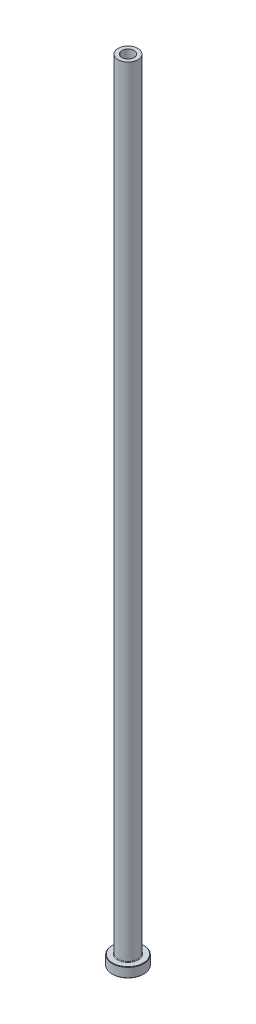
from build123d import *

# Parameters (mm, degrees)
FILLET1_R     = 0.3
CHAMFER1_SIZE = 0.2
CHAMFER3_SIZE = 0.5


with BuildPart() as part:
    # Sketch1 → Revolve1 (revolve)
    with BuildSketch(Plane.XY, mode=Mode.PRIVATE) as revolve1_sk:
        Polygon((-3.1, 400), (-5, 400), (-5, 5), (-8, 5), (-8, 0), (-3.35, 0), (-3.35, 343), (-3.1, 355), align=None)
    revolve(revolve1_sk.sketch.rotate(Axis((0, 92.187680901, 0), (0, -1, 0)), 270), axis=Axis((0, 92.187680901, 0), (0, -1, 0)))

    # Fillet1
    fillet1_edges = [part.edges().sort_by_distance(p)[0] for p in [
        (0, 5, -5),
    ]]
    fillet(fillet1_edges, radius=FILLET1_R)

    # Chamfer1
    chamfer1_edges = [part.edges().sort_by_distance(p)[0] for p in [
        (0, 0, -8),
        (0, 5, -8),
    ]]
    chamfer(chamfer1_edges, length=CHAMFER1_SIZE)

    # Chamfer3
    chamfer3_edges = [part.edges().sort_by_distance(p)[0] for p in [
        (0, 0, -3.35),
    ]]
    chamfer(chamfer3_edges, length=CHAMFER3_SIZE)


solid = part.part
